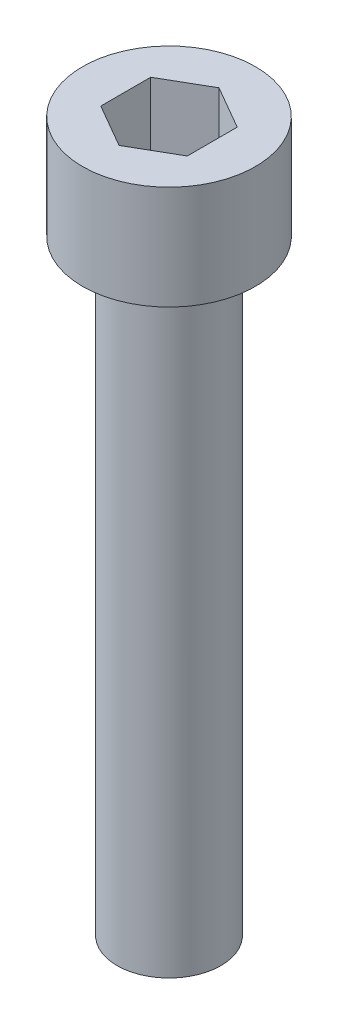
ISO-10303-21;
HEADER;
FILE_DESCRIPTION(('STEP AP214'),'2;1');
FILE_NAME('part.step','',(''),(''),'','','');
FILE_SCHEMA(('AUTOMOTIVE_DESIGN { 1 0 10303 214 1 1 1 1 }'));
ENDSEC;
DATA;
#1=APPLICATION_CONTEXT('core data for automotive mechanical design processes');
#2=APPLICATION_PROTOCOL_DEFINITION('international standard','automotive_design',2000,#1);
#3=PRODUCT_CONTEXT('',#1,'mechanical');
#4=PRODUCT('Part','Part','',(#3));
#5=PRODUCT_RELATED_PRODUCT_CATEGORY('part','',(#4));
#6=PRODUCT_DEFINITION_FORMATION('','',#4);
#7=PRODUCT_DEFINITION_CONTEXT('part definition',#1,'design');
#8=PRODUCT_DEFINITION('design','',#6,#7);
#9=PRODUCT_DEFINITION_SHAPE('','',#8);
#10=(LENGTH_UNIT() NAMED_UNIT(*) SI_UNIT(.MILLI.,.METRE.));
#11=(NAMED_UNIT(*) PLANE_ANGLE_UNIT() SI_UNIT($,.RADIAN.));
#12=(NAMED_UNIT(*) SI_UNIT($,.STERADIAN.) SOLID_ANGLE_UNIT());
#13=UNCERTAINTY_MEASURE_WITH_UNIT(LENGTH_MEASURE(1.E-05),#10,'distance_accuracy_value','');
#14=(GEOMETRIC_REPRESENTATION_CONTEXT(3) GLOBAL_UNCERTAINTY_ASSIGNED_CONTEXT((#13)) GLOBAL_UNIT_ASSIGNED_CONTEXT((#10,
#11,#12)) REPRESENTATION_CONTEXT('',''));
#15=CARTESIAN_POINT('',(0.,0.,0.));
#16=DIRECTION('',(0.,0.,1.));
#17=DIRECTION('',(1.,0.,0.));
#18=AXIS2_PLACEMENT_3D('',#15,#16,#17);
#19=CARTESIAN_POINT('',(0.,0.,0.));
#20=DIRECTION('',(0.,1.,0.));
#21=DIRECTION('',(0.,0.,1.));
#22=AXIS2_PLACEMENT_3D('',#19,#20,#21);
#23=CYLINDRICAL_SURFACE('',#22,3.);
#24=CARTESIAN_POINT('',(0.,0.,0.));
#25=DIRECTION('',(0.,1.,0.));
#26=DIRECTION('',(0.,0.,1.));
#27=AXIS2_PLACEMENT_3D('',#24,#25,#26);
#28=CIRCLE('',#27,3.);
#29=CARTESIAN_POINT('',(0.,0.,3.));
#30=VERTEX_POINT('',#29);
#31=EDGE_CURVE('E25',#30,#30,#28,.F.);
#32=ORIENTED_EDGE('',*,*,#31,.T.);
#33=EDGE_LOOP('',(#32));
#34=FACE_BOUND('',#33,.T.);
#35=CARTESIAN_POINT('',(0.,-35.,0.));
#36=DIRECTION('',(0.,-1.,0.));
#37=DIRECTION('',(0.,0.,-1.));
#38=AXIS2_PLACEMENT_3D('',#35,#36,#37);
#39=CIRCLE('',#38,3.);
#40=CARTESIAN_POINT('',(0.,-35.,-3.));
#41=VERTEX_POINT('',#40);
#42=EDGE_CURVE('E111',#41,#41,#39,.T.);
#43=ORIENTED_EDGE('',*,*,#42,.F.);
#44=EDGE_LOOP('',(#43));
#45=FACE_BOUND('',#44,.T.);
#46=ADVANCED_FACE('F17',(#34,#45),#23,.T.);
#47=CARTESIAN_POINT('',(0.,1.74,-2.88675134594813));
#48=DIRECTION('',(0.,1.,0.));
#49=DIRECTION('',(0.,0.,1.));
#50=AXIS2_PLACEMENT_3D('',#47,#48,#49);
#51=PLANE('',#50);
#52=DIRECTION('',(0.,0.,1.));
#53=VECTOR('',#52,1.);
#54=CARTESIAN_POINT('',(2.5,1.74,-1.44337567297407));
#55=LINE('',#54,#53);
#56=CARTESIAN_POINT('',(2.5,1.74,-1.44337567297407));
#57=VERTEX_POINT('',#56);
#58=CARTESIAN_POINT('',(2.5,1.74,1.44337567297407));
#59=VERTEX_POINT('',#58);
#60=EDGE_CURVE('E73',#57,#59,#55,.T.);
#61=ORIENTED_EDGE('',*,*,#60,.F.);
#62=DIRECTION('',(-0.866025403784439,0.,-0.5));
#63=VECTOR('',#62,1.);
#64=CARTESIAN_POINT('',(2.5,1.74,-1.44337567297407));
#65=LINE('',#64,#63);
#66=CARTESIAN_POINT('',(0.,1.74,-2.88675134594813));
#67=VERTEX_POINT('',#66);
#68=EDGE_CURVE('E94',#57,#67,#65,.T.);
#69=ORIENTED_EDGE('',*,*,#68,.T.);
#70=DIRECTION('',(0.866025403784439,0.,-0.5));
#71=VECTOR('',#70,1.);
#72=CARTESIAN_POINT('',(-2.5,1.74,-1.44337567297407));
#73=LINE('',#72,#71);
#74=CARTESIAN_POINT('',(-2.5,1.74,-1.44337567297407));
#75=VERTEX_POINT('',#74);
#76=EDGE_CURVE('E88',#75,#67,#73,.T.);
#77=ORIENTED_EDGE('',*,*,#76,.F.);
#78=DIRECTION('',(0.,0.,1.));
#79=VECTOR('',#78,1.);
#80=CARTESIAN_POINT('',(-2.5,1.74,-1.44337567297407));
#81=LINE('',#80,#79);
#82=CARTESIAN_POINT('',(-2.5,1.74,1.44337567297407));
#83=VERTEX_POINT('',#82);
#84=EDGE_CURVE('E108',#75,#83,#81,.T.);
#85=ORIENTED_EDGE('',*,*,#84,.T.);
#86=DIRECTION('',(0.866025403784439,0.,0.5));
#87=VECTOR('',#86,1.);
#88=CARTESIAN_POINT('',(-2.5,1.74,1.44337567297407));
#89=LINE('',#88,#87);
#90=CARTESIAN_POINT('',(0.,1.74,2.88675134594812));
#91=VERTEX_POINT('',#90);
#92=EDGE_CURVE('E102',#83,#91,#89,.T.);
#93=ORIENTED_EDGE('',*,*,#92,.T.);
#94=DIRECTION('',(-0.866025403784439,0.,0.5));
#95=VECTOR('',#94,1.);
#96=CARTESIAN_POINT('',(2.5,1.74,1.44337567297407));
#97=LINE('',#96,#95);
#98=EDGE_CURVE('E100',#59,#91,#97,.T.);
#99=ORIENTED_EDGE('',*,*,#98,.F.);
#100=EDGE_LOOP('',(#61,#69,#77,#85,#93,#99));
#101=FACE_BOUND('',#100,.T.);
#102=ADVANCED_FACE('F127',(#101),#51,.T.);
#103=CARTESIAN_POINT('',(-2.5,1.74,-1.44337567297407));
#104=DIRECTION('',(0.5,0.,0.866025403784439));
#105=DIRECTION('',(0.866025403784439,0.,-0.5));
#106=AXIS2_PLACEMENT_3D('',#103,#104,#105);
#107=PLANE('',#106);
#108=ORIENTED_EDGE('',*,*,#76,.T.);
#109=DIRECTION('',(0.,1.,0.));
#110=VECTOR('',#109,1.);
#111=CARTESIAN_POINT('',(0.,1.74,-2.88675134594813));
#112=LINE('',#111,#110);
#113=CARTESIAN_POINT('',(0.,6.,-2.88675134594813));
#114=VERTEX_POINT('',#113);
#115=EDGE_CURVE('E86',#67,#114,#112,.T.);
#116=ORIENTED_EDGE('',*,*,#115,.T.);
#117=DIRECTION('',(-0.866025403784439,0.,0.5));
#118=VECTOR('',#117,1.);
#119=CARTESIAN_POINT('',(0.,6.,-2.88675134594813));
#120=LINE('',#119,#118);
#121=CARTESIAN_POINT('',(-2.5,6.,-1.44337567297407));
#122=VERTEX_POINT('',#121);
#123=EDGE_CURVE('E79',#114,#122,#120,.T.);
#124=ORIENTED_EDGE('',*,*,#123,.T.);
#125=DIRECTION('',(0.,1.,0.));
#126=VECTOR('',#125,1.);
#127=CARTESIAN_POINT('',(-2.5,1.74,-1.44337567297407));
#128=LINE('',#127,#126);
#129=EDGE_CURVE('E91',#122,#75,#128,.F.);
#130=ORIENTED_EDGE('',*,*,#129,.T.);
#131=EDGE_LOOP('',(#108,#116,#124,#130));
#132=FACE_BOUND('',#131,.T.);
#133=ADVANCED_FACE('F134',(#132),#107,.T.);
#134=CARTESIAN_POINT('',(-2.5,1.74,-1.44337567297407));
#135=DIRECTION('',(-1.,0.,0.));
#136=DIRECTION('',(0.,0.,1.));
#137=AXIS2_PLACEMENT_3D('',#134,#135,#136);
#138=PLANE('',#137);
#139=DIRECTION('',(0.,1.,0.));
#140=VECTOR('',#139,1.);
#141=CARTESIAN_POINT('',(-2.5,1.74,1.44337567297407));
#142=LINE('',#141,#140);
#143=CARTESIAN_POINT('',(-2.5,6.,1.44337567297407));
#144=VERTEX_POINT('',#143);
#145=EDGE_CURVE('E105',#144,#83,#142,.F.);
#146=ORIENTED_EDGE('',*,*,#145,.T.);
#147=ORIENTED_EDGE('',*,*,#84,.F.);
#148=ORIENTED_EDGE('',*,*,#129,.F.);
#149=DIRECTION('',(0.,0.,-1.));
#150=VECTOR('',#149,1.);
#151=CARTESIAN_POINT('',(-2.5,6.,0.));
#152=LINE('',#151,#150);
#153=EDGE_CURVE('E84',#122,#144,#152,.F.);
#154=ORIENTED_EDGE('',*,*,#153,.T.);
#155=EDGE_LOOP('',(#146,#147,#148,#154));
#156=FACE_BOUND('',#155,.T.);
#157=ADVANCED_FACE('F153',(#156),#138,.F.);
#158=CARTESIAN_POINT('',(-2.5,1.74,1.44337567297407));
#159=DIRECTION('',(-0.5,0.,0.866025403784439));
#160=DIRECTION('',(0.866025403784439,0.,0.5));
#161=AXIS2_PLACEMENT_3D('',#158,#159,#160);
#162=PLANE('',#161);
#163=DIRECTION('',(0.,1.,0.));
#164=VECTOR('',#163,1.);
#165=CARTESIAN_POINT('',(0.,1.74,2.88675134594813));
#166=LINE('',#165,#164);
#167=CARTESIAN_POINT('',(0.,6.,2.88675134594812));
#168=VERTEX_POINT('',#167);
#169=EDGE_CURVE('E62',#91,#168,#166,.T.);
#170=ORIENTED_EDGE('',*,*,#169,.F.);
#171=ORIENTED_EDGE('',*,*,#92,.F.);
#172=ORIENTED_EDGE('',*,*,#145,.F.);
#173=DIRECTION('',(0.866025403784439,0.,0.5));
#174=VECTOR('',#173,1.);
#175=CARTESIAN_POINT('',(-2.5,6.,1.44337567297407));
#176=LINE('',#175,#174);
#177=EDGE_CURVE('E67',#144,#168,#176,.T.);
#178=ORIENTED_EDGE('',*,*,#177,.T.);
#179=EDGE_LOOP('',(#170,#171,#172,#178));
#180=FACE_BOUND('',#179,.T.);
#181=ADVANCED_FACE('F161',(#180),#162,.F.);
#182=CARTESIAN_POINT('',(2.5,1.74,1.44337567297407));
#183=DIRECTION('',(-0.5,0.,-0.866025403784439));
#184=DIRECTION('',(-0.866025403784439,0.,0.5));
#185=AXIS2_PLACEMENT_3D('',#182,#183,#184);
#186=PLANE('',#185);
#187=ORIENTED_EDGE('',*,*,#98,.T.);
#188=ORIENTED_EDGE('',*,*,#169,.T.);
#189=DIRECTION('',(0.86602540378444,0.,-0.5));
#190=VECTOR('',#189,1.);
#191=CARTESIAN_POINT('',(0.,6.,2.88675134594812));
#192=LINE('',#191,#190);
#193=CARTESIAN_POINT('',(2.5,6.,1.44337567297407));
#194=VERTEX_POINT('',#193);
#195=EDGE_CURVE('E54',#168,#194,#192,.T.);
#196=ORIENTED_EDGE('',*,*,#195,.T.);
#197=DIRECTION('',(0.,1.,0.));
#198=VECTOR('',#197,1.);
#199=CARTESIAN_POINT('',(2.5,1.74,1.44337567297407));
#200=LINE('',#199,#198);
#201=EDGE_CURVE('E59',#59,#194,#200,.T.);
#202=ORIENTED_EDGE('',*,*,#201,.F.);
#203=EDGE_LOOP('',(#187,#188,#196,#202));
#204=FACE_BOUND('',#203,.T.);
#205=ADVANCED_FACE('F57',(#204),#186,.T.);
#206=CARTESIAN_POINT('',(2.5,1.74,-1.44337567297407));
#207=DIRECTION('',(-1.,0.,0.));
#208=DIRECTION('',(0.,0.,1.));
#209=AXIS2_PLACEMENT_3D('',#206,#207,#208);
#210=PLANE('',#209);
#211=ORIENTED_EDGE('',*,*,#60,.T.);
#212=ORIENTED_EDGE('',*,*,#201,.T.);
#213=DIRECTION('',(0.,0.,-1.));
#214=VECTOR('',#213,1.);
#215=CARTESIAN_POINT('',(2.5,6.,0.));
#216=LINE('',#215,#214);
#217=CARTESIAN_POINT('',(2.5,6.,-1.44337567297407));
#218=VERTEX_POINT('',#217);
#219=EDGE_CURVE('E66',#194,#218,#216,.T.);
#220=ORIENTED_EDGE('',*,*,#219,.T.);
#221=DIRECTION('',(0.,1.,0.));
#222=VECTOR('',#221,1.);
#223=CARTESIAN_POINT('',(2.5,1.74,-1.44337567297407));
#224=LINE('',#223,#222);
#225=EDGE_CURVE('E74',#218,#57,#224,.F.);
#226=ORIENTED_EDGE('',*,*,#225,.T.);
#227=EDGE_LOOP('',(#211,#212,#220,#226));
#228=FACE_BOUND('',#227,.T.);
#229=ADVANCED_FACE('F70',(#228),#210,.T.);
#230=CARTESIAN_POINT('',(2.5,1.74,-1.44337567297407));
#231=DIRECTION('',(0.5,0.,-0.866025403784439));
#232=DIRECTION('',(-0.866025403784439,0.,-0.5));
#233=AXIS2_PLACEMENT_3D('',#230,#231,#232);
#234=PLANE('',#233);
#235=ORIENTED_EDGE('',*,*,#115,.F.);
#236=ORIENTED_EDGE('',*,*,#68,.F.);
#237=ORIENTED_EDGE('',*,*,#225,.F.);
#238=DIRECTION('',(-0.866025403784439,0.,-0.5));
#239=VECTOR('',#238,1.);
#240=CARTESIAN_POINT('',(2.5,6.,-1.44337567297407));
#241=LINE('',#240,#239);
#242=EDGE_CURVE('E32',#218,#114,#241,.T.);
#243=ORIENTED_EDGE('',*,*,#242,.T.);
#244=EDGE_LOOP('',(#235,#236,#237,#243));
#245=FACE_BOUND('',#244,.T.);
#246=ADVANCED_FACE('F154',(#245),#234,.F.);
#247=CARTESIAN_POINT('',(4.75,6.,0.));
#248=DIRECTION('',(0.,-1.,0.));
#249=DIRECTION('',(0.,0.,-1.));
#250=AXIS2_PLACEMENT_3D('',#247,#248,#249);
#251=PLANE('',#250);
#252=CARTESIAN_POINT('',(0.,6.,0.));
#253=DIRECTION('',(0.,-1.,0.));
#254=DIRECTION('',(0.,0.,-1.));
#255=AXIS2_PLACEMENT_3D('',#252,#253,#254);
#256=CIRCLE('',#255,5.);
#257=CARTESIAN_POINT('',(0.,6.,-5.));
#258=VERTEX_POINT('',#257);
#259=EDGE_CURVE('E11',#258,#258,#256,.T.);
#260=ORIENTED_EDGE('',*,*,#259,.F.);
#261=EDGE_LOOP('',(#260));
#262=FACE_BOUND('',#261,.T.);
#263=ORIENTED_EDGE('',*,*,#242,.F.);
#264=ORIENTED_EDGE('',*,*,#219,.F.);
#265=ORIENTED_EDGE('',*,*,#195,.F.);
#266=ORIENTED_EDGE('',*,*,#177,.F.);
#267=ORIENTED_EDGE('',*,*,#153,.F.);
#268=ORIENTED_EDGE('',*,*,#123,.F.);
#269=EDGE_LOOP('',(#263,#264,#265,#266,#267,#268));
#270=FACE_BOUND('',#269,.T.);
#271=ADVANCED_FACE('F76',(#262,#270),#251,.F.);
#272=CARTESIAN_POINT('',(0.,0.,0.));
#273=DIRECTION('',(0.,1.,0.));
#274=DIRECTION('',(0.,0.,1.));
#275=AXIS2_PLACEMENT_3D('',#272,#273,#274);
#276=CYLINDRICAL_SURFACE('',#275,5.);
#277=CARTESIAN_POINT('',(0.,0.,0.));
#278=DIRECTION('',(0.,1.,0.));
#279=DIRECTION('',(0.,0.,1.));
#280=AXIS2_PLACEMENT_3D('',#277,#278,#279);
#281=CIRCLE('',#280,5.);
#282=CARTESIAN_POINT('',(0.,0.,5.));
#283=VERTEX_POINT('',#282);
#284=EDGE_CURVE('E113',#283,#283,#281,.T.);
#285=ORIENTED_EDGE('',*,*,#284,.T.);
#286=EDGE_LOOP('',(#285));
#287=FACE_BOUND('',#286,.T.);
#288=ORIENTED_EDGE('',*,*,#259,.T.);
#289=EDGE_LOOP('',(#288));
#290=FACE_BOUND('',#289,.T.);
#291=ADVANCED_FACE('F142',(#287,#290),#276,.T.);
#292=CARTESIAN_POINT('',(3.,0.,0.));
#293=DIRECTION('',(0.,1.,0.));
#294=DIRECTION('',(0.,0.,1.));
#295=AXIS2_PLACEMENT_3D('',#292,#293,#294);
#296=PLANE('',#295);
#297=ORIENTED_EDGE('',*,*,#31,.F.);
#298=EDGE_LOOP('',(#297));
#299=FACE_BOUND('',#298,.T.);
#300=ORIENTED_EDGE('',*,*,#284,.F.);
#301=EDGE_LOOP('',(#300));
#302=FACE_BOUND('',#301,.T.);
#303=ADVANCED_FACE('F139',(#299,#302),#296,.F.);
#304=CARTESIAN_POINT('',(0.,-35.,0.));
#305=DIRECTION('',(0.,-1.,0.));
#306=DIRECTION('',(0.,0.,-1.));
#307=AXIS2_PLACEMENT_3D('',#304,#305,#306);
#308=PLANE('',#307);
#309=ORIENTED_EDGE('',*,*,#42,.T.);
#310=EDGE_LOOP('',(#309));
#311=FACE_BOUND('',#310,.T.);
#312=ADVANCED_FACE('F124',(#311),#308,.T.);
#313=CLOSED_SHELL('',(#46,#102,#133,#157,#181,#205,#229,#246,#271,#291,#303,#312));
#314=MANIFOLD_SOLID_BREP('B1',#313);
#315=ADVANCED_BREP_SHAPE_REPRESENTATION('',(#18,#314),#14);
#316=SHAPE_DEFINITION_REPRESENTATION(#9,#315);
ENDSEC;
END-ISO-10303-21;
